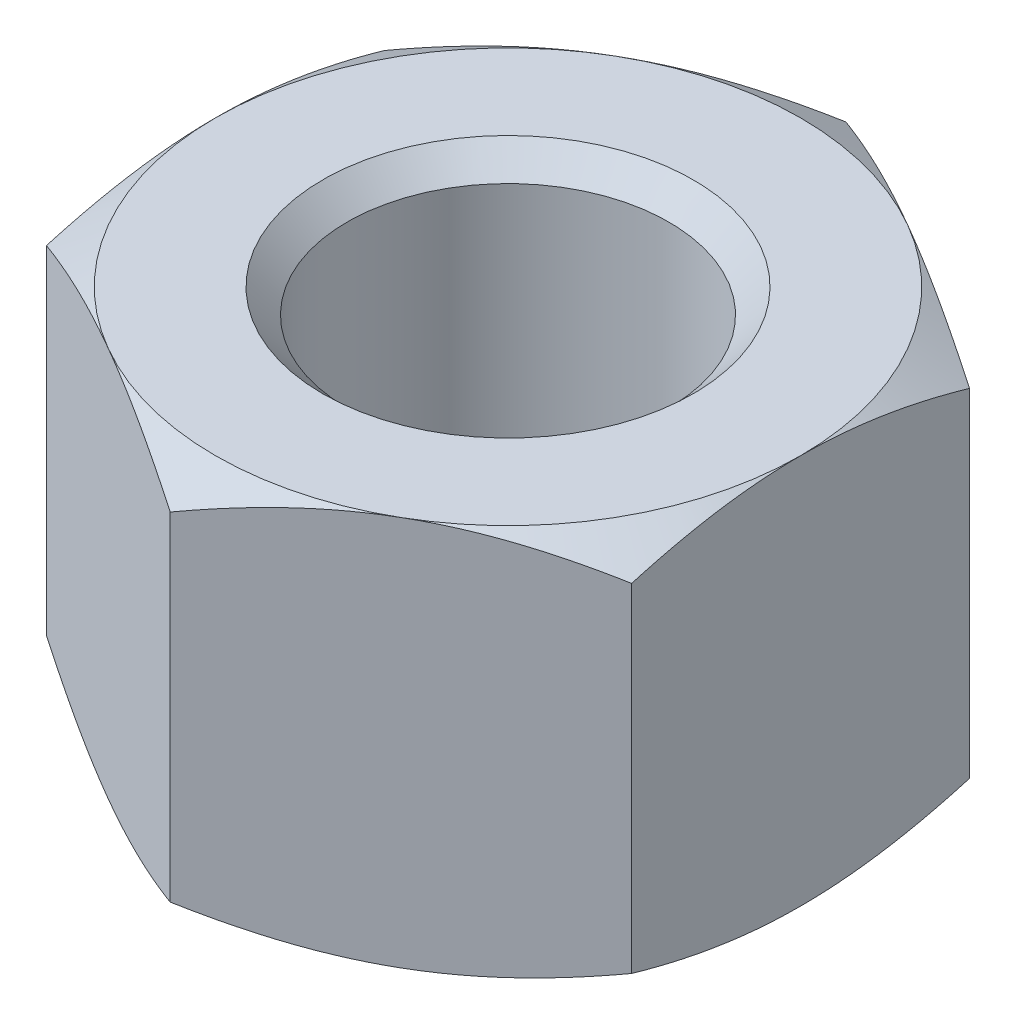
from build123d import *

# Parameters (mm, degrees)
BOSS_EXTRUDE1_DEPTH     = 2
SKETCH2_OUTSIDE_W       = 18.314
SKETCH2_OUTSIDE_H       = 19.242
SKETCH2_OUTSIDE_R       = 3
CUT_EXTRUDE1_DEPTH      = 2.4
CUT_EXTRUDE1_DRAFT      = -60
MIRROR1_COPY_1_SKETCH_W = 18.314
MIRROR1_COPY_1_SKETCH_H = 19.242
MIRROR1_COPY_1_SKETCH_R = 3
MIRROR1_COPY_1_DEPTH    = 2.4
MIRROR1_COPY_1_DRAFT    = -60
TAPPED_HOLE1_D          = 3.3
CHAMFER1_SIZE           = 0.25


with BuildPart() as part:
    # Sketch1 → Boss-Extrude1 (new, symmetric)
    with BuildSketch(Plane(origin=(0, 0, 0), x_dir=(1, 0, 0), z_dir=(0, 1, 0))):
        Polygon((3, -1.732050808), (3, 1.732050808), (0, 3.464101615), (-3, 1.732050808), (-3, -1.732050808), (0, -3.464101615), align=None)
    extrude(amount=BOSS_EXTRUDE1_DEPTH, both=True)


with BuildPart() as cut_extrude1_tool:
    # Sketch2 outside → Cut-Extrude1 (with draft: the straight prism first)
    with BuildSketch(Plane(origin=(0, 2, 0), x_dir=(1, 0, 0), z_dir=(0, 1, 0))):
        Rectangle(SKETCH2_OUTSIDE_W, SKETCH2_OUTSIDE_H)
        Circle(SKETCH2_OUTSIDE_R, mode=Mode.SUBTRACT)
    extrude(amount=-CUT_EXTRUDE1_DEPTH)
    # Cut-Extrude1: the draft: its side faces are tilted about the plane it starts from
    cut_extrude1_sides = [cut_extrude1_tool.faces().sort_by_distance(p)[0] for p in [
        (0, 0.8, 9.621),
        (9.157, 0.8, 0),
        (0, 0.8, -9.621),
        (-9.157, 0.8, 0),
        (-3, 0.8, 0),
    ]]
    draft(cut_extrude1_sides, Plane(origin=(0, 2, 0), x_dir=(1, 0, 0), z_dir=(0, 1, 0)), CUT_EXTRUDE1_DRAFT)


with BuildPart() as part_1:
    add(part.part)

    # Cut-Extrude1: cut by cut_extrude1_tool
    add(cut_extrude1_tool.part, mode=Mode.SUBTRACT)


with BuildPart() as mirror1_copy_1_tool:
    # Mirror1 copy 1 sketch → Mirror1 copy 1 (with draft: the straight prism first)
    with BuildSketch(Plane.XZ.offset(2)):
        Rectangle(MIRROR1_COPY_1_SKETCH_W, MIRROR1_COPY_1_SKETCH_H)
        Circle(MIRROR1_COPY_1_SKETCH_R, mode=Mode.SUBTRACT)
    extrude(amount=-MIRROR1_COPY_1_DEPTH)
    # Mirror1 copy 1: the draft: its side faces are tilted about the plane it starts from
    mirror1_copy_1_sides = [mirror1_copy_1_tool.faces().sort_by_distance(p)[0] for p in [
        (0, -0.8, 9.621),
        (9.157, -0.8, 0),
        (0, -0.8, -9.621),
        (-9.157, -0.8, 0),
        (-3, -0.8, 0),
    ]]
    draft(mirror1_copy_1_sides, Plane.XZ.offset(2), MIRROR1_COPY_1_DRAFT)


with BuildPart() as part_2:
    add(part_1.part)

    # Mirror1 copy 1: cut by mirror1_copy_1_tool
    add(mirror1_copy_1_tool.part, mode=Mode.SUBTRACT)

    # Tapped Hole1 (through all)
    with Locations(Plane(origin=(0, -2, 0), x_dir=(-1, 0, 0), z_dir=(0, -1, 0))):
        with Locations((0, 0)):
            Hole(TAPPED_HOLE1_D / 2)

    # Chamfer1
    chamfer1_edges = [part_2.edges().sort_by_distance(p)[0] for p in [
        (-1.65, -2, 0),
        (-1.65, 2, 0),
    ]]
    chamfer(chamfer1_edges, length=CHAMFER1_SIZE)


solid = part_2.part
